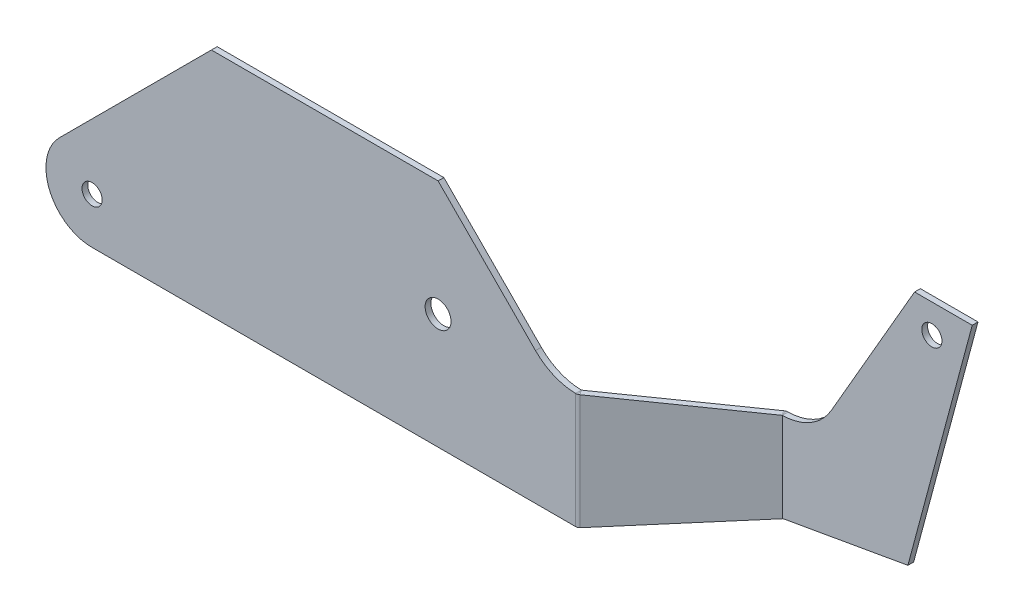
ISO-10303-21;
HEADER;
FILE_DESCRIPTION(('STEP AP214'),'2;1');
FILE_NAME('part.step','',(''),(''),'','','');
FILE_SCHEMA(('AUTOMOTIVE_DESIGN { 1 0 10303 214 1 1 1 1 }'));
ENDSEC;
DATA;
#1=APPLICATION_CONTEXT('core data for automotive mechanical design processes');
#2=APPLICATION_PROTOCOL_DEFINITION('international standard','automotive_design',2000,#1);
#3=PRODUCT_CONTEXT('',#1,'mechanical');
#4=PRODUCT('Part','Part','',(#3));
#5=PRODUCT_RELATED_PRODUCT_CATEGORY('part','',(#4));
#6=PRODUCT_DEFINITION_FORMATION('','',#4);
#7=PRODUCT_DEFINITION_CONTEXT('part definition',#1,'design');
#8=PRODUCT_DEFINITION('design','',#6,#7);
#9=PRODUCT_DEFINITION_SHAPE('','',#8);
#10=(LENGTH_UNIT() NAMED_UNIT(*) SI_UNIT(.MILLI.,.METRE.));
#11=(NAMED_UNIT(*) PLANE_ANGLE_UNIT() SI_UNIT($,.RADIAN.));
#12=(NAMED_UNIT(*) SI_UNIT($,.STERADIAN.) SOLID_ANGLE_UNIT());
#13=UNCERTAINTY_MEASURE_WITH_UNIT(LENGTH_MEASURE(1.E-05),#10,'distance_accuracy_value','');
#14=(GEOMETRIC_REPRESENTATION_CONTEXT(3) GLOBAL_UNCERTAINTY_ASSIGNED_CONTEXT((#13)) GLOBAL_UNIT_ASSIGNED_CONTEXT((#10,
#11,#12)) REPRESENTATION_CONTEXT('',''));
#15=CARTESIAN_POINT('',(0.,0.,0.));
#16=DIRECTION('',(0.,0.,1.));
#17=DIRECTION('',(1.,0.,0.));
#18=AXIS2_PLACEMENT_3D('',#15,#16,#17);
#19=CARTESIAN_POINT('',(24.2959312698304,29.9999896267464,0.90668993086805));
#20=DIRECTION('',(0.573576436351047,0.,0.819152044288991));
#21=DIRECTION('',(0.819152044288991,0.,-0.573576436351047));
#22=AXIS2_PLACEMENT_3D('',#19,#20,#21);
#23=PLANE('',#22);
#24=DIRECTION('',(0.806707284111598,0.173648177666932,-0.564862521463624));
#25=VECTOR('',#24,1.);
#26=CARTESIAN_POINT('',(24.2959312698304,0.,0.90668993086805));
#27=LINE('',#26,#25);
#28=CARTESIAN_POINT('',(24.4235311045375,0.0274665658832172,0.817343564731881));
#29=VERTEX_POINT('',#28);
#30=CARTESIAN_POINT('',(45.0567085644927,4.4688714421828,-13.6301628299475));
#31=VERTEX_POINT('',#30);
#32=EDGE_CURVE('E831',#29,#31,#27,.T.);
#33=ORIENTED_EDGE('',*,*,#32,.T.);
#34=DIRECTION('',(0.,1.,0.));
#35=VECTOR('',#34,1.);
#36=CARTESIAN_POINT('',(45.0567085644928,29.9999896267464,-13.6301628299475));
#37=LINE('',#36,#35);
#38=CARTESIAN_POINT('',(45.0567085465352,19.9999896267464,-13.6301628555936));
#39=VERTEX_POINT('',#38);
#40=EDGE_CURVE('E634',#31,#39,#37,.T.);
#41=ORIENTED_EDGE('',*,*,#40,.T.);
#42=DIRECTION('',(-0.819152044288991,0.,0.573576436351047));
#43=VECTOR('',#42,1.);
#44=CARTESIAN_POINT('',(45.1843083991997,19.9999896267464,-13.7195091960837));
#45=LINE('',#44,#43);
#46=CARTESIAN_POINT('',(24.4235311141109,19.9999896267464,0.817343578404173));
#47=VERTEX_POINT('',#46);
#48=EDGE_CURVE('E828',#39,#47,#45,.T.);
#49=ORIENTED_EDGE('',*,*,#48,.T.);
#50=DIRECTION('',(0.,1.,0.));
#51=VECTOR('',#50,1.);
#52=CARTESIAN_POINT('',(24.4235311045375,29.9999896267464,0.817343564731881));
#53=LINE('',#52,#51);
#54=EDGE_CURVE('E825',#29,#47,#53,.T.);
#55=ORIENTED_EDGE('',*,*,#54,.F.);
#56=EDGE_LOOP('',(#33,#41,#49,#55));
#57=FACE_BOUND('',#56,.T.);
#58=ADVANCED_FACE('F66',(#57),#23,.T.);
#59=CARTESIAN_POINT('',(45.1843083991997,19.9999896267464,-13.7195091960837));
#60=DIRECTION('',(0.,-1.,0.));
#61=DIRECTION('',(0.819152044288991,0.,-0.573576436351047));
#62=AXIS2_PLACEMENT_3D('',#59,#60,#61);
#63=PLANE('',#62);
#64=DIRECTION('',(0.573576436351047,0.,0.819152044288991));
#65=VECTOR('',#64,1.);
#66=CARTESIAN_POINT('',(45.0567085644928,19.9999896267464,-13.6301628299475));
#67=LINE('',#66,#65);
#68=CARTESIAN_POINT('',(44.4831321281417,19.9999896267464,-14.4493148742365));
#69=VERTEX_POINT('',#68);
#70=EDGE_CURVE('E12',#69,#39,#67,.T.);
#71=ORIENTED_EDGE('',*,*,#70,.F.);
#72=DIRECTION('',(-0.819152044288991,0.,0.573576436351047));
#73=VECTOR('',#72,1.);
#74=CARTESIAN_POINT('',(44.6107319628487,19.9999896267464,-14.5386612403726));
#75=LINE('',#74,#73);
#76=CARTESIAN_POINT('',(23.8499546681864,19.9999896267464,-0.00180847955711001));
#77=VERTEX_POINT('',#76);
#78=EDGE_CURVE('E85',#69,#77,#75,.T.);
#79=ORIENTED_EDGE('',*,*,#78,.T.);
#80=DIRECTION('',(0.573576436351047,0.,0.819152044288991));
#81=VECTOR('',#80,1.);
#82=CARTESIAN_POINT('',(24.4235311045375,19.9999896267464,0.817343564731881));
#83=LINE('',#82,#81);
#84=EDGE_CURVE('E822',#77,#47,#83,.T.);
#85=ORIENTED_EDGE('',*,*,#84,.T.);
#86=ORIENTED_EDGE('',*,*,#48,.F.);
#87=EDGE_LOOP('',(#71,#79,#85,#86));
#88=FACE_BOUND('',#87,.T.);
#89=ADVANCED_FACE('F613',(#88),#63,.F.);
#90=CARTESIAN_POINT('',(24.2959312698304,0.,0.90668993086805));
#91=DIRECTION('',(-0.142244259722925,0.984807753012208,0.0996005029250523));
#92=DIRECTION('',(-0.806707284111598,-0.173648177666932,0.564862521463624));
#93=AXIS2_PLACEMENT_3D('',#90,#91,#92);
#94=PLANE('',#93);
#95=CARTESIAN_POINT('',(45.0567085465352,4.46887144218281,-13.6301628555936));
#96=CARTESIAN_POINT('',(44.483132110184,4.46887144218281,-14.4493148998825));
#97=B_SPLINE_CURVE_WITH_KNOTS('',1,(#95,#96),.UNSPECIFIED.,.F.,.F.,(2,2),(0.,1.),.UNSPECIFIED.);
#98=CARTESIAN_POINT('',(44.4831321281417,4.46887144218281,-14.4493148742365));
#99=VERTEX_POINT('',#98);
#100=EDGE_CURVE('E353',#31,#99,#97,.T.);
#101=ORIENTED_EDGE('',*,*,#100,.F.);
#102=ORIENTED_EDGE('',*,*,#32,.F.);
#103=CARTESIAN_POINT('',(23.8499546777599,0.0274665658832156,-0.00180846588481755));
#104=CARTESIAN_POINT('',(24.4235311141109,0.0274665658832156,0.817343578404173));
#105=B_SPLINE_CURVE_WITH_KNOTS('',1,(#103,#104),.UNSPECIFIED.,.F.,.F.,(2,2),(0.,1.),.UNSPECIFIED.);
#106=CARTESIAN_POINT('',(23.8499546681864,0.0274665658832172,-0.00180847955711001));
#107=VERTEX_POINT('',#106);
#108=EDGE_CURVE('E642',#29,#107,#105,.F.);
#109=ORIENTED_EDGE('',*,*,#108,.T.);
#110=DIRECTION('',(0.806707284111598,0.173648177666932,-0.564862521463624));
#111=VECTOR('',#110,1.);
#112=CARTESIAN_POINT('',(23.7223548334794,0.,0.0875378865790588));
#113=LINE('',#112,#111);
#114=EDGE_CURVE('E93',#107,#99,#113,.T.);
#115=ORIENTED_EDGE('',*,*,#114,.T.);
#116=EDGE_LOOP('',(#101,#102,#109,#115));
#117=FACE_BOUND('',#116,.T.);
#118=ADVANCED_FACE('F616',(#117),#94,.F.);
#119=CARTESIAN_POINT('',(23.7223548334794,29.9999896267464,0.0875378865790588));
#120=DIRECTION('',(0.573576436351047,0.,0.819152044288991));
#121=DIRECTION('',(0.819152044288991,0.,-0.573576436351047));
#122=AXIS2_PLACEMENT_3D('',#119,#120,#121);
#123=PLANE('',#122);
#124=DIRECTION('',(0.,1.,0.));
#125=VECTOR('',#124,1.);
#126=CARTESIAN_POINT('',(44.4831321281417,29.9999896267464,-14.4493148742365));
#127=LINE('',#126,#125);
#128=EDGE_CURVE('E77',#99,#69,#127,.T.);
#129=ORIENTED_EDGE('',*,*,#128,.F.);
#130=ORIENTED_EDGE('',*,*,#114,.F.);
#131=DIRECTION('',(0.,1.,0.));
#132=VECTOR('',#131,1.);
#133=CARTESIAN_POINT('',(23.8499546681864,29.9999896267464,-0.00180847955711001));
#134=LINE('',#133,#132);
#135=EDGE_CURVE('E789',#107,#77,#134,.T.);
#136=ORIENTED_EDGE('',*,*,#135,.T.);
#137=ORIENTED_EDGE('',*,*,#78,.F.);
#138=EDGE_LOOP('',(#129,#130,#136,#137));
#139=FACE_BOUND('',#138,.T.);
#140=ADVANCED_FACE('F68',(#139),#123,.F.);
#141=CARTESIAN_POINT('',(-60.0000104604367,8.00000000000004,1.));
#142=DIRECTION('',(0.,0.,-1.));
#143=DIRECTION('',(-1.,0.,0.));
#144=AXIS2_PLACEMENT_3D('',#141,#142,#143);
#145=CYLINDRICAL_SURFACE('',#144,7.99999999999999);
#146=CARTESIAN_POINT('',(-60.0000104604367,8.00000000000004,0.));
#147=DIRECTION('',(0.,0.,1.));
#148=DIRECTION('',(1.,0.,0.));
#149=AXIS2_PLACEMENT_3D('',#146,#147,#148);
#150=CIRCLE('',#149,7.99999999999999);
#151=CARTESIAN_POINT('',(-65.656864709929,13.6568542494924,0.));
#152=VERTEX_POINT('',#151);
#153=CARTESIAN_POINT('',(-60.0000104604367,0.,0.));
#154=VERTEX_POINT('',#153);
#155=EDGE_CURVE('E570',#152,#154,#150,.T.);
#156=ORIENTED_EDGE('',*,*,#155,.T.);
#157=DIRECTION('',(0.,0.,-1.));
#158=VECTOR('',#157,1.);
#159=CARTESIAN_POINT('',(-60.0000104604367,0.,1.));
#160=LINE('',#159,#158);
#161=CARTESIAN_POINT('',(-60.0000104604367,0.,1.));
#162=VERTEX_POINT('',#161);
#163=EDGE_CURVE('E522',#162,#154,#160,.T.);
#164=ORIENTED_EDGE('',*,*,#163,.F.);
#165=CARTESIAN_POINT('',(-60.0000104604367,8.00000000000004,1.));
#166=DIRECTION('',(0.,0.,1.));
#167=DIRECTION('',(1.,0.,0.));
#168=AXIS2_PLACEMENT_3D('',#165,#166,#167);
#169=CIRCLE('',#168,7.99999999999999);
#170=CARTESIAN_POINT('',(-65.656864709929,13.6568542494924,1.));
#171=VERTEX_POINT('',#170);
#172=EDGE_CURVE('E532',#171,#162,#169,.T.);
#173=ORIENTED_EDGE('',*,*,#172,.F.);
#174=DIRECTION('',(0.,0.,-1.));
#175=VECTOR('',#174,1.);
#176=CARTESIAN_POINT('',(-65.656864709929,13.6568542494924,1.));
#177=LINE('',#176,#175);
#178=EDGE_CURVE('E567',#171,#152,#177,.T.);
#179=ORIENTED_EDGE('',*,*,#178,.T.);
#180=EDGE_LOOP('',(#156,#164,#173,#179));
#181=FACE_BOUND('',#180,.T.);
#182=ADVANCED_FACE('F475',(#181),#145,.T.);
#183=CARTESIAN_POINT('',(-65.656864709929,13.6568542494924,1.));
#184=DIRECTION('',(0.707106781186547,-0.707106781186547,0.));
#185=DIRECTION('',(0.707106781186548,0.707106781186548,0.));
#186=AXIS2_PLACEMENT_3D('',#183,#184,#185);
#187=PLANE('',#186);
#188=DIRECTION('',(-0.707106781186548,-0.707106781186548,0.));
#189=VECTOR('',#188,1.);
#190=CARTESIAN_POINT('',(-65.656864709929,13.6568542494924,0.));
#191=LINE('',#190,#189);
#192=CARTESIAN_POINT('',(-39.3137189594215,40.,0.));
#193=VERTEX_POINT('',#192);
#194=EDGE_CURVE('E565',#193,#152,#191,.T.);
#195=ORIENTED_EDGE('',*,*,#194,.T.);
#196=ORIENTED_EDGE('',*,*,#178,.F.);
#197=DIRECTION('',(-0.707106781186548,-0.707106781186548,0.));
#198=VECTOR('',#197,1.);
#199=CARTESIAN_POINT('',(-65.656864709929,13.6568542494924,1.));
#200=LINE('',#199,#198);
#201=CARTESIAN_POINT('',(-39.3137189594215,40.,1.));
#202=VERTEX_POINT('',#201);
#203=EDGE_CURVE('E534',#202,#171,#200,.T.);
#204=ORIENTED_EDGE('',*,*,#203,.F.);
#205=DIRECTION('',(0.,0.,-1.));
#206=VECTOR('',#205,1.);
#207=CARTESIAN_POINT('',(-39.3137189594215,40.,1.));
#208=LINE('',#207,#206);
#209=EDGE_CURVE('E562',#202,#193,#208,.T.);
#210=ORIENTED_EDGE('',*,*,#209,.T.);
#211=EDGE_LOOP('',(#195,#196,#204,#210));
#212=FACE_BOUND('',#211,.T.);
#213=ADVANCED_FACE('F809',(#212),#187,.F.);
#214=CARTESIAN_POINT('',(0.,40.,1.));
#215=DIRECTION('',(0.,-1.,0.));
#216=DIRECTION('',(1.,0.,0.));
#217=AXIS2_PLACEMENT_3D('',#214,#215,#216);
#218=PLANE('',#217);
#219=DIRECTION('',(-1.,0.,0.));
#220=VECTOR('',#219,1.);
#221=CARTESIAN_POINT('',(0.,40.,0.));
#222=LINE('',#221,#220);
#223=CARTESIAN_POINT('',(0.,40.,0.));
#224=VERTEX_POINT('',#223);
#225=EDGE_CURVE('E560',#224,#193,#222,.T.);
#226=ORIENTED_EDGE('',*,*,#225,.T.);
#227=ORIENTED_EDGE('',*,*,#209,.F.);
#228=DIRECTION('',(-1.,0.,0.));
#229=VECTOR('',#228,1.);
#230=CARTESIAN_POINT('',(0.,40.,1.));
#231=LINE('',#230,#229);
#232=CARTESIAN_POINT('',(0.,40.,1.));
#233=VERTEX_POINT('',#232);
#234=EDGE_CURVE('E536',#233,#202,#231,.T.);
#235=ORIENTED_EDGE('',*,*,#234,.F.);
#236=DIRECTION('',(0.,0.,-1.));
#237=VECTOR('',#236,1.);
#238=CARTESIAN_POINT('',(0.,40.,1.));
#239=LINE('',#238,#237);
#240=EDGE_CURVE('E557',#233,#224,#239,.T.);
#241=ORIENTED_EDGE('',*,*,#240,.T.);
#242=EDGE_LOOP('',(#226,#227,#235,#241));
#243=FACE_BOUND('',#242,.T.);
#244=ADVANCED_FACE('F812',(#243),#218,.F.);
#245=CARTESIAN_POINT('',(0.,40.,1.));
#246=DIRECTION('',(-0.710059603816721,-0.704141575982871,0.));
#247=DIRECTION('',(0.704141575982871,-0.710059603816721,0.));
#248=AXIS2_PLACEMENT_3D('',#245,#246,#247);
#249=PLANE('',#248);
#250=DIRECTION('',(-0.704141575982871,0.710059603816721,0.));
#251=VECTOR('',#250,1.);
#252=CARTESIAN_POINT('',(0.,40.,0.));
#253=LINE('',#252,#251);
#254=CARTESIAN_POINT('',(16.8993935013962,22.9585738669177,0.));
#255=VERTEX_POINT('',#254);
#256=EDGE_CURVE('E554',#255,#224,#253,.T.);
#257=ORIENTED_EDGE('',*,*,#256,.T.);
#258=ORIENTED_EDGE('',*,*,#240,.F.);
#259=DIRECTION('',(-0.704141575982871,0.710059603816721,0.));
#260=VECTOR('',#259,1.);
#261=CARTESIAN_POINT('',(0.,40.,1.));
#262=LINE('',#261,#260);
#263=CARTESIAN_POINT('',(16.8993935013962,22.9585738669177,1.));
#264=VERTEX_POINT('',#263);
#265=EDGE_CURVE('E538',#264,#233,#262,.T.);
#266=ORIENTED_EDGE('',*,*,#265,.F.);
#267=DIRECTION('',(0.,0.,-1.));
#268=VECTOR('',#267,1.);
#269=CARTESIAN_POINT('',(16.8993935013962,22.9585738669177,1.));
#270=LINE('',#269,#268);
#271=EDGE_CURVE('E551',#264,#255,#270,.T.);
#272=ORIENTED_EDGE('',*,*,#271,.T.);
#273=EDGE_LOOP('',(#257,#258,#266,#272));
#274=FACE_BOUND('',#273,.T.);
#275=ADVANCED_FACE('F816',(#274),#249,.F.);
#276=CARTESIAN_POINT('',(-60.0000104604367,8.00000000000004,1.));
#277=DIRECTION('',(0.,0.,-1.));
#278=DIRECTION('',(-1.,0.,0.));
#279=AXIS2_PLACEMENT_3D('',#276,#277,#278);
#280=CYLINDRICAL_SURFACE('',#279,1.75);
#281=CARTESIAN_POINT('',(-60.0000104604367,8.00000000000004,1.));
#282=DIRECTION('',(0.,0.,1.));
#283=DIRECTION('',(1.,0.,0.));
#284=AXIS2_PLACEMENT_3D('',#281,#282,#283);
#285=CIRCLE('',#284,1.75);
#286=CARTESIAN_POINT('',(-58.2500104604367,8.00000000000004,1.));
#287=VERTEX_POINT('',#286);
#288=EDGE_CURVE('E548',#287,#287,#285,.T.);
#289=ORIENTED_EDGE('',*,*,#288,.T.);
#290=EDGE_LOOP('',(#289));
#291=FACE_BOUND('',#290,.T.);
#292=CARTESIAN_POINT('',(-60.0000104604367,8.00000000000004,0.));
#293=DIRECTION('',(0.,0.,1.));
#294=DIRECTION('',(1.,0.,0.));
#295=AXIS2_PLACEMENT_3D('',#292,#293,#294);
#296=CIRCLE('',#295,1.75);
#297=CARTESIAN_POINT('',(-58.2500104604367,8.00000000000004,0.));
#298=VERTEX_POINT('',#297);
#299=EDGE_CURVE('E525',#298,#298,#296,.T.);
#300=ORIENTED_EDGE('',*,*,#299,.F.);
#301=EDGE_LOOP('',(#300));
#302=FACE_BOUND('',#301,.T.);
#303=ADVANCED_FACE('F1053',(#291,#302),#280,.F.);
#304=CARTESIAN_POINT('',(0.,19.9999896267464,1.));
#305=DIRECTION('',(0.,0.,-1.));
#306=DIRECTION('',(-1.,0.,0.));
#307=AXIS2_PLACEMENT_3D('',#304,#305,#306);
#308=CYLINDRICAL_SURFACE('',#307,2.25);
#309=CARTESIAN_POINT('',(0.,19.9999896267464,1.));
#310=DIRECTION('',(0.,0.,1.));
#311=DIRECTION('',(1.,0.,0.));
#312=AXIS2_PLACEMENT_3D('',#309,#310,#311);
#313=CIRCLE('',#312,2.25);
#314=CARTESIAN_POINT('',(2.25,19.9999896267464,1.));
#315=VERTEX_POINT('',#314);
#316=EDGE_CURVE('E545',#315,#315,#313,.T.);
#317=ORIENTED_EDGE('',*,*,#316,.T.);
#318=EDGE_LOOP('',(#317));
#319=FACE_BOUND('',#318,.T.);
#320=CARTESIAN_POINT('',(0.,19.9999896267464,0.));
#321=DIRECTION('',(0.,0.,1.));
#322=DIRECTION('',(1.,0.,0.));
#323=AXIS2_PLACEMENT_3D('',#320,#321,#322);
#324=CIRCLE('',#323,2.25);
#325=CARTESIAN_POINT('',(2.25,19.9999896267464,0.));
#326=VERTEX_POINT('',#325);
#327=EDGE_CURVE('E528',#326,#326,#324,.T.);
#328=ORIENTED_EDGE('',*,*,#327,.F.);
#329=EDGE_LOOP('',(#328));
#330=FACE_BOUND('',#329,.T.);
#331=ADVANCED_FACE('F1044',(#319,#330),#308,.F.);
#332=CARTESIAN_POINT('',(23.9999895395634,29.9999896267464,1.));
#333=DIRECTION('',(0.,0.,1.));
#334=DIRECTION('',(1.,0.,0.));
#335=AXIS2_PLACEMENT_3D('',#332,#333,#334);
#336=PLANE('',#335);
#337=ORIENTED_EDGE('',*,*,#316,.F.);
#338=EDGE_LOOP('',(#337));
#339=FACE_BOUND('',#338,.T.);
#340=ORIENTED_EDGE('',*,*,#288,.F.);
#341=EDGE_LOOP('',(#340));
#342=FACE_BOUND('',#341,.T.);
#343=DIRECTION('',(1.,0.,0.));
#344=VECTOR('',#343,1.);
#345=CARTESIAN_POINT('',(23.9999895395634,0.,1.));
#346=LINE('',#345,#344);
#347=CARTESIAN_POINT('',(23.8442189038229,0.,1.));
#348=VERTEX_POINT('',#347);
#349=EDGE_CURVE('E542',#162,#348,#346,.T.);
#350=ORIENTED_EDGE('',*,*,#349,.T.);
#351=DIRECTION('',(0.,1.,0.));
#352=VECTOR('',#351,1.);
#353=CARTESIAN_POINT('',(23.8442189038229,29.9999896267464,1.));
#354=LINE('',#353,#352);
#355=CARTESIAN_POINT('',(23.8442189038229,20.001202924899,1.00000001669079));
#356=VERTEX_POINT('',#355);
#357=EDGE_CURVE('E544',#348,#356,#354,.T.);
#358=ORIENTED_EDGE('',*,*,#357,.T.);
#359=CARTESIAN_POINT('',(23.9999895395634,29.9999896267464,1.));
#360=DIRECTION('',(0.,0.,-1.));
#361=DIRECTION('',(1.,0.,0.));
#362=AXIS2_PLACEMENT_3D('',#359,#360,#361);
#363=CIRCLE('',#362,10.);
#364=EDGE_CURVE('E541',#356,#264,#363,.T.);
#365=ORIENTED_EDGE('',*,*,#364,.T.);
#366=ORIENTED_EDGE('',*,*,#265,.T.);
#367=ORIENTED_EDGE('',*,*,#234,.T.);
#368=ORIENTED_EDGE('',*,*,#203,.T.);
#369=ORIENTED_EDGE('',*,*,#172,.T.);
#370=EDGE_LOOP('',(#350,#358,#365,#366,#367,#368,#369));
#371=FACE_BOUND('',#370,.T.);
#372=ADVANCED_FACE('F604',(#339,#342,#371),#336,.T.);
#373=CARTESIAN_POINT('',(23.9999895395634,29.9999896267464,1.));
#374=DIRECTION('',(0.,0.,-1.));
#375=DIRECTION('',(-1.,0.,0.));
#376=AXIS2_PLACEMENT_3D('',#373,#374,#375);
#377=CYLINDRICAL_SURFACE('',#376,10.);
#378=CARTESIAN_POINT('',(23.8442189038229,20.001202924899,1.66907874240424E-08));
#379=CARTESIAN_POINT('',(23.8442189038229,20.001202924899,1.00000001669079));
#380=B_SPLINE_CURVE_WITH_KNOTS('',1,(#378,#379),.UNSPECIFIED.,.F.,.F.,(2,2),(0.,1.),.UNSPECIFIED.);
#381=CARTESIAN_POINT('',(23.8442189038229,20.001202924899,0.));
#382=VERTEX_POINT('',#381);
#383=EDGE_CURVE('E572',#382,#356,#380,.T.);
#384=ORIENTED_EDGE('',*,*,#383,.F.);
#385=CARTESIAN_POINT('',(23.9999895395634,29.9999896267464,0.));
#386=DIRECTION('',(0.,0.,-1.));
#387=DIRECTION('',(1.,0.,0.));
#388=AXIS2_PLACEMENT_3D('',#385,#386,#387);
#389=CIRCLE('',#388,10.);
#390=EDGE_CURVE('E531',#382,#255,#389,.T.);
#391=ORIENTED_EDGE('',*,*,#390,.T.);
#392=ORIENTED_EDGE('',*,*,#271,.F.);
#393=ORIENTED_EDGE('',*,*,#364,.F.);
#394=EDGE_LOOP('',(#384,#391,#392,#393));
#395=FACE_BOUND('',#394,.T.);
#396=ADVANCED_FACE('F593',(#395),#377,.F.);
#397=CARTESIAN_POINT('',(23.9999895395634,29.9999896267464,0.));
#398=DIRECTION('',(0.,0.,1.));
#399=DIRECTION('',(1.,0.,0.));
#400=AXIS2_PLACEMENT_3D('',#397,#398,#399);
#401=PLANE('',#400);
#402=DIRECTION('',(0.,1.,0.));
#403=VECTOR('',#402,1.);
#404=CARTESIAN_POINT('',(23.8442189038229,29.9999896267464,0.));
#405=LINE('',#404,#403);
#406=CARTESIAN_POINT('',(23.8442189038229,0.,0.));
#407=VERTEX_POINT('',#406);
#408=EDGE_CURVE('E576',#407,#382,#405,.T.);
#409=ORIENTED_EDGE('',*,*,#408,.F.);
#410=DIRECTION('',(1.,0.,0.));
#411=VECTOR('',#410,1.);
#412=CARTESIAN_POINT('',(23.9999895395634,0.,0.));
#413=LINE('',#412,#411);
#414=EDGE_CURVE('E515',#154,#407,#413,.T.);
#415=ORIENTED_EDGE('',*,*,#414,.F.);
#416=ORIENTED_EDGE('',*,*,#155,.F.);
#417=ORIENTED_EDGE('',*,*,#194,.F.);
#418=ORIENTED_EDGE('',*,*,#225,.F.);
#419=ORIENTED_EDGE('',*,*,#256,.F.);
#420=ORIENTED_EDGE('',*,*,#390,.F.);
#421=EDGE_LOOP('',(#409,#415,#416,#417,#418,#419,#420));
#422=FACE_BOUND('',#421,.T.);
#423=ORIENTED_EDGE('',*,*,#327,.T.);
#424=EDGE_LOOP('',(#423));
#425=FACE_BOUND('',#424,.T.);
#426=ORIENTED_EDGE('',*,*,#299,.T.);
#427=EDGE_LOOP('',(#426));
#428=FACE_BOUND('',#427,.T.);
#429=ADVANCED_FACE('F603',(#422,#425,#428),#401,.F.);
#430=CARTESIAN_POINT('',(23.9999895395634,0.,1.));
#431=DIRECTION('',(0.,1.,0.));
#432=DIRECTION('',(-1.,0.,0.));
#433=AXIS2_PLACEMENT_3D('',#430,#431,#432);
#434=PLANE('',#433);
#435=DIRECTION('',(0.,0.,-1.));
#436=VECTOR('',#435,1.);
#437=CARTESIAN_POINT('',(23.8442189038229,0.,1.));
#438=LINE('',#437,#436);
#439=EDGE_CURVE('E573',#348,#407,#438,.T.);
#440=ORIENTED_EDGE('',*,*,#439,.F.);
#441=ORIENTED_EDGE('',*,*,#349,.F.);
#442=ORIENTED_EDGE('',*,*,#163,.T.);
#443=ORIENTED_EDGE('',*,*,#414,.T.);
#444=EDGE_LOOP('',(#440,#441,#442,#443));
#445=FACE_BOUND('',#444,.T.);
#446=ADVANCED_FACE('F608',(#445),#434,.F.);
#447=CARTESIAN_POINT('',(23.8442189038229,0.,-0.0100000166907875));
#448=DIRECTION('',(0.,-1.,0.));
#449=DIRECTION('',(0.,0.,-1.));
#450=AXIS2_PLACEMENT_3D('',#447,#448,#449);
#451=PLANE('',#450);
#452=ORIENTED_EDGE('',*,*,#439,.T.);
#453=CARTESIAN_POINT('',(23.8442189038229,0.,-0.01));
#454=DIRECTION('',(0.,1.,0.));
#455=DIRECTION('',(0.,0.,1.));
#456=AXIS2_PLACEMENT_3D('',#453,#454,#455);
#457=CIRCLE('',#456,0.0100000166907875);
#458=CARTESIAN_POINT('',(23.847225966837,0.,-0.000462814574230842));
#459=VERTEX_POINT('',#458);
#460=EDGE_CURVE('E723',#407,#459,#457,.T.);
#461=ORIENTED_EDGE('',*,*,#460,.T.);
#462=CARTESIAN_POINT('',(24.1479317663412,0.,0.953254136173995));
#463=CARTESIAN_POINT('',(23.847225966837,0.,-0.000462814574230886));
#464=B_SPLINE_CURVE_WITH_KNOTS('',1,(#462,#463),.UNSPECIFIED.,.F.,.F.,(2,2),(0.,1.),.UNSPECIFIED.);
#465=CARTESIAN_POINT('',(24.1479317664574,0.,0.95325413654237));
#466=VERTEX_POINT('',#465);
#467=EDGE_CURVE('E577',#459,#466,#464,.F.);
#468=ORIENTED_EDGE('',*,*,#467,.T.);
#469=CARTESIAN_POINT('',(23.8442189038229,0.,-0.0100000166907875));
#470=DIRECTION('',(0.,1.,0.));
#471=DIRECTION('',(0.,0.,1.));
#472=AXIS2_PLACEMENT_3D('',#469,#470,#471);
#473=CIRCLE('',#472,1.01000003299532);
#474=EDGE_CURVE('E792',#348,#466,#473,.T.);
#475=ORIENTED_EDGE('',*,*,#474,.F.);
#476=EDGE_LOOP('',(#452,#461,#468,#475));
#477=FACE_BOUND('',#476,.T.);
#478=ADVANCED_FACE('F473',(#477),#451,.T.);
#479=CARTESIAN_POINT('',(24.1479317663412,0.,0.953254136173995));
#480=CARTESIAN_POINT('',(24.2460242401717,0.00915764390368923,0.92232569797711));
#481=CARTESIAN_POINT('',(24.3392790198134,0.0183089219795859,0.876337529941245));
#482=CARTESIAN_POINT('',(24.4235311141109,0.0274665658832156,0.817343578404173));
#483=CARTESIAN_POINT('',(23.847225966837,0.,-0.000462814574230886));
#484=CARTESIAN_POINT('',(23.8481969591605,0.00915555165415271,-0.000768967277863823));
#485=CARTESIAN_POINT('',(23.8491206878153,0.0183110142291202,-0.00122449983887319));
#486=CARTESIAN_POINT('',(23.8499546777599,0.0274665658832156,-0.00180846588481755));
#487=B_SPLINE_SURFACE_WITH_KNOTS('',1,3,((#479,#480,#481,#482),(#483,#484,#485,#486)),
.UNSPECIFIED.,.F.,.F.,.F.,(2,2),(4,4),(0.,1.),(0.,1.),.UNSPECIFIED.);
#488=CARTESIAN_POINT('',(23.847225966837,0.,-0.000462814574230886));
#489=CARTESIAN_POINT('',(23.8481969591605,0.00915555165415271,-0.000768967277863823));
#490=CARTESIAN_POINT('',(23.8491206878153,0.0183110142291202,-0.00122449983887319));
#491=CARTESIAN_POINT('',(23.8499546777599,0.0274665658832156,-0.00180846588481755));
#492=B_SPLINE_CURVE_WITH_KNOTS('',3,(#488,#489,#490,#491),.UNSPECIFIED.,.F.,.F.,(4,4),(0.,1.),.UNSPECIFIED.);
#493=EDGE_CURVE('E451',#459,#107,#492,.T.);
#494=CARTESIAN_POINT('',(24.4235311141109,0.0274665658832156,0.817343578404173));
#495=CARTESIAN_POINT('',(24.3392790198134,0.0183089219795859,0.876337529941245));
#496=CARTESIAN_POINT('',(24.2460242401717,0.00915764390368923,0.92232569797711));
#497=CARTESIAN_POINT('',(24.1479317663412,0.,0.953254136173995));
#498=B_SPLINE_CURVE_WITH_KNOTS('',3,(#494,#495,#496,#497),.UNSPECIFIED.,.F.,.F.,(4,4),(0.,1.),.UNSPECIFIED.);
#499=EDGE_CURVE('E430',#466,#29,#498,.F.);
#500=ORIENTED_EDGE('',*,*,#467,.F.);
#501=ORIENTED_EDGE('',*,*,#493,.T.);
#502=ORIENTED_EDGE('',*,*,#108,.F.);
#503=ORIENTED_EDGE('',*,*,#499,.F.);
#504=EDGE_LOOP('',(#500,#501,#502,#503));
#505=FACE_BOUND('',#504,.T.);
#506=ADVANCED_FACE('F742',(#505),#487,.T.);
#507=CARTESIAN_POINT('',(23.8442189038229,19.9999896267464,-0.0100000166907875));
#508=DIRECTION('',(0.,1.,0.));
#509=DIRECTION('',(0.,0.,1.));
#510=AXIS2_PLACEMENT_3D('',#507,#508,#509);
#511=PLANE('',#510);
#512=ORIENTED_EDGE('',*,*,#84,.F.);
#513=CARTESIAN_POINT('',(23.8442189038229,19.9999896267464,-0.01));
#514=DIRECTION('',(0.,1.,0.));
#515=DIRECTION('',(0.,0.,1.));
#516=AXIS2_PLACEMENT_3D('',#513,#514,#515);
#517=CIRCLE('',#516,0.0100000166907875);
#518=CARTESIAN_POINT('',(23.847225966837,19.9999896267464,-0.000462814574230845));
#519=VERTEX_POINT('',#518);
#520=EDGE_CURVE('E443',#77,#519,#517,.F.);
#521=ORIENTED_EDGE('',*,*,#520,.T.);
#522=CARTESIAN_POINT('',(24.1479317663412,19.9999896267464,0.953254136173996));
#523=CARTESIAN_POINT('',(23.847225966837,19.9999896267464,-0.000462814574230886));
#524=B_SPLINE_CURVE_WITH_KNOTS('',1,(#522,#523),.UNSPECIFIED.,.F.,.F.,(2,2),(0.,1.),.UNSPECIFIED.);
#525=CARTESIAN_POINT('',(24.1479317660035,19.9999896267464,0.953254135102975));
#526=VERTEX_POINT('',#525);
#527=EDGE_CURVE('E503',#519,#526,#524,.F.);
#528=ORIENTED_EDGE('',*,*,#527,.T.);
#529=CARTESIAN_POINT('',(23.8442189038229,19.9999896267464,-0.0100000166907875));
#530=DIRECTION('',(0.,-1.,0.));
#531=DIRECTION('',(0.,0.,-1.));
#532=AXIS2_PLACEMENT_3D('',#529,#530,#531);
#533=CIRCLE('',#532,1.01000003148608);
#534=EDGE_CURVE('E428',#47,#526,#533,.T.);
#535=ORIENTED_EDGE('',*,*,#534,.F.);
#536=EDGE_LOOP('',(#512,#521,#528,#535));
#537=FACE_BOUND('',#536,.T.);
#538=ADVANCED_FACE('F404',(#537),#511,.T.);
#539=CARTESIAN_POINT('',(24.1479317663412,19.9999896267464,0.953254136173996));
#540=CARTESIAN_POINT('',(24.0498391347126,20.0003941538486,0.984182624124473));
#541=CARTESIAN_POINT('',(23.9470718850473,20.0007983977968,1.00000001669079));
#542=CARTESIAN_POINT('',(23.8442189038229,20.001202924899,1.00000001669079));
#543=CARTESIAN_POINT('',(23.847225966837,19.9999896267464,-0.000462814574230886));
#544=CARTESIAN_POINT('',(23.8462547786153,20.0003941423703,-0.000156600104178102));
#545=CARTESIAN_POINT('',(23.8452372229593,20.0007984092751,1.66907874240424E-08));
#546=CARTESIAN_POINT('',(23.8442189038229,20.001202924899,1.66907874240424E-08));
#547=B_SPLINE_SURFACE_WITH_KNOTS('',1,3,((#539,#540,#541,#542),(#543,#544,#545,#546)),
.UNSPECIFIED.,.F.,.F.,.F.,(2,2),(4,4),(0.,1.),(0.,1.),.UNSPECIFIED.);
#548=CARTESIAN_POINT('',(23.847225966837,19.9999896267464,-0.000462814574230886));
#549=CARTESIAN_POINT('',(23.8462547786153,20.0003941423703,-0.000156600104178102));
#550=CARTESIAN_POINT('',(23.8452372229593,20.0007984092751,1.66907874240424E-08));
#551=CARTESIAN_POINT('',(23.8442189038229,20.001202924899,1.66907874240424E-08));
#552=B_SPLINE_CURVE_WITH_KNOTS('',3,(#548,#549,#550,#551),.UNSPECIFIED.,.F.,.F.,(4,4),(0.,1.),.UNSPECIFIED.);
#553=EDGE_CURVE('E439',#519,#382,#552,.T.);
#554=CARTESIAN_POINT('',(23.8442189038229,20.001202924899,1.00000001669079));
#555=CARTESIAN_POINT('',(23.9470718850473,20.0007983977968,1.00000001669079));
#556=CARTESIAN_POINT('',(24.0498391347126,20.0003941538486,0.984182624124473));
#557=CARTESIAN_POINT('',(24.1479317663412,19.9999896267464,0.953254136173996));
#558=B_SPLINE_CURVE_WITH_KNOTS('',3,(#554,#555,#556,#557),.UNSPECIFIED.,.F.,.F.,(4,4),(0.,1.),.UNSPECIFIED.);
#559=EDGE_CURVE('E427',#526,#356,#558,.F.);
#560=ORIENTED_EDGE('',*,*,#553,.T.);
#561=ORIENTED_EDGE('',*,*,#383,.T.);
#562=ORIENTED_EDGE('',*,*,#559,.F.);
#563=ORIENTED_EDGE('',*,*,#527,.F.);
#564=EDGE_LOOP('',(#560,#561,#562,#563));
#565=FACE_BOUND('',#564,.T.);
#566=ADVANCED_FACE('F402',(#565),#547,.T.);
#567=CARTESIAN_POINT('',(23.8442189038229,-10.0280074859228,-0.01));
#568=DIRECTION('',(0.,1.,0.));
#569=DIRECTION('',(0.,0.,1.));
#570=AXIS2_PLACEMENT_3D('',#567,#568,#569);
#571=CYLINDRICAL_SURFACE('',#570,1.01000001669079);
#572=ORIENTED_EDGE('',*,*,#534,.T.);
#573=ORIENTED_EDGE('',*,*,#559,.T.);
#574=ORIENTED_EDGE('',*,*,#357,.F.);
#575=ORIENTED_EDGE('',*,*,#474,.T.);
#576=ORIENTED_EDGE('',*,*,#499,.T.);
#577=ORIENTED_EDGE('',*,*,#54,.T.);
#578=EDGE_LOOP('',(#572,#573,#574,#575,#576,#577));
#579=FACE_BOUND('',#578,.T.);
#580=ADVANCED_FACE('F393',(#579),#571,.T.);
#581=CARTESIAN_POINT('',(23.8442189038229,-10.0280074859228,-0.01));
#582=DIRECTION('',(0.,1.,0.));
#583=DIRECTION('',(0.,0.,1.));
#584=AXIS2_PLACEMENT_3D('',#581,#582,#583);
#585=CYLINDRICAL_SURFACE('',#584,0.0100000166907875);
#586=ORIENTED_EDGE('',*,*,#520,.F.);
#587=ORIENTED_EDGE('',*,*,#135,.F.);
#588=ORIENTED_EDGE('',*,*,#493,.F.);
#589=ORIENTED_EDGE('',*,*,#460,.F.);
#590=ORIENTED_EDGE('',*,*,#408,.T.);
#591=ORIENTED_EDGE('',*,*,#553,.F.);
#592=EDGE_LOOP('',(#586,#587,#588,#589,#590,#591));
#593=FACE_BOUND('',#592,.T.);
#594=ADVANCED_FACE('F327',(#593),#585,.F.);
#595=CARTESIAN_POINT('',(44.483132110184,4.46887144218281,-14.4493148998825));
#596=CARTESIAN_POINT('',(44.65205136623,4.48711063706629,-14.5675934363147));
#597=CARTESIAN_POINT('',(44.856232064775,4.50532296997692,-14.6319713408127));
#598=CARTESIAN_POINT('',(45.0624443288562,4.52380457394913,-14.6319713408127));
#599=CARTESIAN_POINT('',(45.0567085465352,4.46887144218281,-13.6301628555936));
#600=CARTESIAN_POINT('',(45.0583766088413,4.48706253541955,-13.6313308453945));
#601=CARTESIAN_POINT('',(45.0604080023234,4.50537171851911,-13.6319713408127));
#602=CARTESIAN_POINT('',(45.0624443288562,4.52380457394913,-13.6319713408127));
#603=B_SPLINE_SURFACE_WITH_KNOTS('',1,3,((#595,#596,#597,#598),(#599,#600,#601,#602)),
.UNSPECIFIED.,.F.,.F.,.F.,(2,2),(4,4),(0.,1.),(0.,1.),.UNSPECIFIED.);
#604=CARTESIAN_POINT('',(44.483132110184,4.46887144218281,-14.4493148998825));
#605=CARTESIAN_POINT('',(44.65205136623,4.48711063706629,-14.5675934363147));
#606=CARTESIAN_POINT('',(44.856232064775,4.50532296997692,-14.6319713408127));
#607=CARTESIAN_POINT('',(45.0624443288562,4.52380457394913,-14.6319713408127));
#608=B_SPLINE_CURVE_WITH_KNOTS('',3,(#604,#605,#606,#607),.UNSPECIFIED.,.F.,.F.,(4,4),(0.,1.),.UNSPECIFIED.);
#609=CARTESIAN_POINT('',(45.0624443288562,4.52380457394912,-14.6319713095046));
#610=VERTEX_POINT('',#609);
#611=EDGE_CURVE('E300',#99,#610,#608,.T.);
#612=CARTESIAN_POINT('',(45.0624443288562,4.52380457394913,-14.6319713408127));
#613=CARTESIAN_POINT('',(45.0624443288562,4.52380457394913,-13.6319713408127));
#614=B_SPLINE_CURVE_WITH_KNOTS('',1,(#612,#613),.UNSPECIFIED.,.F.,.F.,(2,2),(0.,1.),.UNSPECIFIED.);
#615=CARTESIAN_POINT('',(45.0624443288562,4.52380457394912,-13.6319713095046));
#616=VERTEX_POINT('',#615);
#617=EDGE_CURVE('E215',#616,#610,#614,.F.);
#618=CARTESIAN_POINT('',(45.0624443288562,4.52380457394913,-13.6319713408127));
#619=CARTESIAN_POINT('',(45.0604080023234,4.50537171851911,-13.6319713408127));
#620=CARTESIAN_POINT('',(45.0583766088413,4.48706253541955,-13.6313308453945));
#621=CARTESIAN_POINT('',(45.0567085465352,4.46887144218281,-13.6301628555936));
#622=B_SPLINE_CURVE_WITH_KNOTS('',3,(#618,#619,#620,#621),.UNSPECIFIED.,.F.,.F.,(4,4),(0.,1.),.UNSPECIFIED.);
#623=EDGE_CURVE('E294',#31,#616,#622,.F.);
#624=ORIENTED_EDGE('',*,*,#100,.T.);
#625=ORIENTED_EDGE('',*,*,#611,.T.);
#626=ORIENTED_EDGE('',*,*,#617,.F.);
#627=ORIENTED_EDGE('',*,*,#623,.F.);
#628=EDGE_LOOP('',(#624,#625,#626,#627));
#629=FACE_BOUND('',#628,.T.);
#630=ADVANCED_FACE('F316',(#629),#603,.F.);
#631=CARTESIAN_POINT('',(45.0624443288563,20.001202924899,-14.6319713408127));
#632=CARTESIAN_POINT('',(44.9672691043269,20.0005253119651,-14.6319713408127));
#633=CARTESIAN_POINT('',(44.864117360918,20.0001204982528,-14.6184535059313));
#634=CARTESIAN_POINT('',(44.7587314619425,19.9999896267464,-14.5852254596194));
#635=CARTESIAN_POINT('',(45.0624443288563,20.001202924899,-13.6319713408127));
#636=CARTESIAN_POINT('',(45.0615016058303,20.0005250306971,-13.6319713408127));
#637=CARTESIAN_POINT('',(45.0604809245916,20.0001205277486,-13.6318375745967));
#638=CARTESIAN_POINT('',(45.0594372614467,19.9999896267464,-13.6315085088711));
#639=B_SPLINE_SURFACE_WITH_KNOTS('',1,3,((#631,#632,#633,#634),(#635,#636,#637,#638)),
.UNSPECIFIED.,.F.,.F.,.F.,(2,2),(4,4),(0.,1.),(0.,1.),.UNSPECIFIED.);
#640=CARTESIAN_POINT('',(45.0624443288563,20.001202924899,-13.6319713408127));
#641=CARTESIAN_POINT('',(45.0624443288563,20.001202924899,-14.6319713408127));
#642=B_SPLINE_CURVE_WITH_KNOTS('',1,(#640,#641),.UNSPECIFIED.,.F.,.F.,(2,2),(0.,1.),.UNSPECIFIED.);
#643=CARTESIAN_POINT('',(45.0624443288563,20.001202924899,-14.6319713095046));
#644=VERTEX_POINT('',#643);
#645=CARTESIAN_POINT('',(45.0624443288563,20.001202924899,-13.6319713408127));
#646=VERTEX_POINT('',#645);
#647=EDGE_CURVE('E684',#644,#646,#642,.F.);
#648=CARTESIAN_POINT('',(45.0624443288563,20.001202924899,-14.6319713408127));
#649=CARTESIAN_POINT('',(44.9672691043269,20.0005253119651,-14.6319713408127));
#650=CARTESIAN_POINT('',(44.864117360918,20.0001204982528,-14.6184535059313));
#651=CARTESIAN_POINT('',(44.7587314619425,19.9999896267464,-14.5852254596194));
#652=B_SPLINE_CURVE_WITH_KNOTS('',3,(#648,#649,#650,#651),.UNSPECIFIED.,.F.,.F.,(4,4),(0.,1.),.UNSPECIFIED.);
#653=CARTESIAN_POINT('',(44.7587314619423,19.9999896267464,-14.5852254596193));
#654=VERTEX_POINT('',#653);
#655=EDGE_CURVE('E689',#644,#654,#652,.T.);
#656=CARTESIAN_POINT('',(44.7587314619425,19.9999896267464,-14.5852254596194));
#657=CARTESIAN_POINT('',(45.0594372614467,19.9999896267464,-13.6315085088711));
#658=B_SPLINE_CURVE_WITH_KNOTS('',1,(#656,#657),.UNSPECIFIED.,.F.,.F.,(2,2),(0.,1.),.UNSPECIFIED.);
#659=CARTESIAN_POINT('',(45.0594372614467,19.9999896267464,-13.6315085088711));
#660=VERTEX_POINT('',#659);
#661=EDGE_CURVE('E366',#654,#660,#658,.T.);
#662=CARTESIAN_POINT('',(45.0594372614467,19.9999896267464,-13.6315085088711));
#663=CARTESIAN_POINT('',(45.0604809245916,20.0001205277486,-13.6318375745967));
#664=CARTESIAN_POINT('',(45.0615016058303,20.0005250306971,-13.6319713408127));
#665=CARTESIAN_POINT('',(45.0624443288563,20.001202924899,-13.6319713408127));
#666=B_SPLINE_CURVE_WITH_KNOTS('',3,(#662,#663,#664,#665),.UNSPECIFIED.,.F.,.F.,(4,4),(0.,1.),.UNSPECIFIED.);
#667=EDGE_CURVE('E691',#646,#660,#666,.F.);
#668=ORIENTED_EDGE('',*,*,#647,.F.);
#669=ORIENTED_EDGE('',*,*,#655,.T.);
#670=ORIENTED_EDGE('',*,*,#661,.T.);
#671=ORIENTED_EDGE('',*,*,#667,.F.);
#672=EDGE_LOOP('',(#668,#669,#670,#671));
#673=FACE_BOUND('',#672,.T.);
#674=ADVANCED_FACE('F269',(#673),#639,.F.);
#675=CARTESIAN_POINT('',(45.0624443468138,19.9999896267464,-13.6219712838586));
#676=DIRECTION('',(2.1667545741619E-11,-1.,-6.83177335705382E-12));
#677=DIRECTION('',(1.,2.1667545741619E-11,0.));
#678=AXIS2_PLACEMENT_3D('',#675,#676,#677);
#679=PLANE('',#678);
#680=CARTESIAN_POINT('',(45.0624443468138,19.9999896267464,-13.6219712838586));
#681=DIRECTION('',(-2.1667545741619E-11,1.,6.83177335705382E-12));
#682=DIRECTION('',(-1.,-2.1667545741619E-11,0.));
#683=AXIS2_PLACEMENT_3D('',#680,#681,#682);
#684=CIRCLE('',#683,1.01000003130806);
#685=EDGE_CURVE('E694',#654,#69,#684,.T.);
#686=ORIENTED_EDGE('',*,*,#685,.T.);
#687=ORIENTED_EDGE('',*,*,#70,.T.);
#688=CARTESIAN_POINT('',(45.0624443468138,19.9999896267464,-13.6219712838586));
#689=DIRECTION('',(-2.1667545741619E-11,1.,6.83177335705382E-12));
#690=DIRECTION('',(-1.,-2.1667545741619E-11,0.));
#691=AXIS2_PLACEMENT_3D('',#688,#689,#690);
#692=CIRCLE('',#691,0.0100000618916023);
#693=EDGE_CURVE('E719',#660,#39,#692,.T.);
#694=ORIENTED_EDGE('',*,*,#693,.F.);
#695=ORIENTED_EDGE('',*,*,#661,.F.);
#696=EDGE_LOOP('',(#686,#687,#694,#695));
#697=FACE_BOUND('',#696,.T.);
#698=ADVANCED_FACE('F267',(#697),#679,.F.);
#699=CARTESIAN_POINT('',(45.0624443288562,-3.35197011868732,-13.6219713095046));
#700=DIRECTION('',(0.,1.,0.));
#701=DIRECTION('',(-1.,0.,0.));
#702=AXIS2_PLACEMENT_3D('',#699,#700,#701);
#703=CYLINDRICAL_SURFACE('',#702,0.0100000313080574);
#704=ORIENTED_EDGE('',*,*,#667,.T.);
#705=ORIENTED_EDGE('',*,*,#693,.T.);
#706=ORIENTED_EDGE('',*,*,#40,.F.);
#707=ORIENTED_EDGE('',*,*,#623,.T.);
#708=DIRECTION('',(0.,1.,0.));
#709=VECTOR('',#708,1.);
#710=CARTESIAN_POINT('',(45.0624443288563,29.9999896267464,-13.6319713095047));
#711=LINE('',#710,#709);
#712=EDGE_CURVE('E249',#616,#646,#711,.T.);
#713=ORIENTED_EDGE('',*,*,#712,.T.);
#714=EDGE_LOOP('',(#704,#705,#706,#707,#713));
#715=FACE_BOUND('',#714,.T.);
#716=ADVANCED_FACE('F256',(#715),#703,.F.);
#717=CARTESIAN_POINT('',(45.0624443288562,-3.35197011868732,-13.6219713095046));
#718=DIRECTION('',(0.,1.,0.));
#719=DIRECTION('',(-1.,0.,0.));
#720=AXIS2_PLACEMENT_3D('',#717,#718,#719);
#721=CYLINDRICAL_SURFACE('',#720,1.01000003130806);
#722=ORIENTED_EDGE('',*,*,#655,.F.);
#723=DIRECTION('',(0.,1.,0.));
#724=VECTOR('',#723,1.);
#725=CARTESIAN_POINT('',(45.0624443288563,29.9999896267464,-14.6319713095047));
#726=LINE('',#725,#724);
#727=EDGE_CURVE('E658',#610,#644,#726,.T.);
#728=ORIENTED_EDGE('',*,*,#727,.F.);
#729=ORIENTED_EDGE('',*,*,#611,.F.);
#730=ORIENTED_EDGE('',*,*,#128,.T.);
#731=ORIENTED_EDGE('',*,*,#685,.F.);
#732=EDGE_LOOP('',(#722,#728,#729,#730,#731));
#733=FACE_BOUND('',#732,.T.);
#734=ADVANCED_FACE('F266',(#733),#721,.T.);
#735=CARTESIAN_POINT('',(71.0006844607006,44.9999896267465,-13.6319713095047));
#736=DIRECTION('',(0.,0.,-1.));
#737=DIRECTION('',(-1.,0.,0.));
#738=AXIS2_PLACEMENT_3D('',#735,#736,#737);
#739=CYLINDRICAL_SURFACE('',#738,1.75);
#740=CARTESIAN_POINT('',(71.0006844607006,44.9999896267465,-13.6319713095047));
#741=DIRECTION('',(0.,0.,1.));
#742=DIRECTION('',(1.,0.,0.));
#743=AXIS2_PLACEMENT_3D('',#740,#741,#742);
#744=CIRCLE('',#743,1.75);
#745=CARTESIAN_POINT('',(72.7506844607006,44.9999896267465,-13.6319713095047));
#746=VERTEX_POINT('',#745);
#747=EDGE_CURVE('E246',#746,#746,#744,.T.);
#748=ORIENTED_EDGE('',*,*,#747,.T.);
#749=EDGE_LOOP('',(#748));
#750=FACE_BOUND('',#749,.T.);
#751=CARTESIAN_POINT('',(71.0006844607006,44.9999896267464,-14.6319713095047));
#752=DIRECTION('',(0.,0.,1.));
#753=DIRECTION('',(1.,0.,0.));
#754=AXIS2_PLACEMENT_3D('',#751,#752,#753);
#755=CIRCLE('',#754,1.75);
#756=CARTESIAN_POINT('',(72.7506844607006,44.9999896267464,-14.6319713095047));
#757=VERTEX_POINT('',#756);
#758=EDGE_CURVE('E221',#757,#757,#755,.T.);
#759=ORIENTED_EDGE('',*,*,#758,.F.);
#760=EDGE_LOOP('',(#759));
#761=FACE_BOUND('',#760,.T.);
#762=ADVANCED_FACE('F890',(#750,#761),#739,.F.);
#763=CARTESIAN_POINT('',(53.5669277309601,24.9999896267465,-13.6319713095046));
#764=DIRECTION('',(0.86602540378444,-0.499999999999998,0.));
#765=DIRECTION('',(0.499999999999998,0.86602540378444,0.));
#766=AXIS2_PLACEMENT_3D('',#763,#764,#765);
#767=PLANE('',#766);
#768=DIRECTION('',(-0.499999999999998,-0.86602540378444,0.));
#769=VECTOR('',#768,1.);
#770=CARTESIAN_POINT('',(53.5669277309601,24.9999896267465,-14.6319713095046));
#771=LINE('',#770,#769);
#772=CARTESIAN_POINT('',(68.0006844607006,49.9999896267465,-14.6319713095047));
#773=VERTEX_POINT('',#772);
#774=CARTESIAN_POINT('',(53.5669277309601,24.9999896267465,-14.6319713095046));
#775=VERTEX_POINT('',#774);
#776=EDGE_CURVE('E244',#773,#775,#771,.T.);
#777=ORIENTED_EDGE('',*,*,#776,.T.);
#778=DIRECTION('',(0.,0.,-1.));
#779=VECTOR('',#778,1.);
#780=CARTESIAN_POINT('',(53.5669277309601,24.9999896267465,-13.6319713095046));
#781=LINE('',#780,#779);
#782=CARTESIAN_POINT('',(53.5669277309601,24.9999896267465,-13.6319713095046));
#783=VERTEX_POINT('',#782);
#784=EDGE_CURVE('E686',#783,#775,#781,.T.);
#785=ORIENTED_EDGE('',*,*,#784,.F.);
#786=DIRECTION('',(-0.499999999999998,-0.86602540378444,0.));
#787=VECTOR('',#786,1.);
#788=CARTESIAN_POINT('',(53.5669277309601,24.9999896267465,-13.6319713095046));
#789=LINE('',#788,#787);
#790=CARTESIAN_POINT('',(68.0006844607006,49.9999896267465,-13.6319713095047));
#791=VERTEX_POINT('',#790);
#792=EDGE_CURVE('E648',#791,#783,#789,.T.);
#793=ORIENTED_EDGE('',*,*,#792,.F.);
#794=DIRECTION('',(0.,0.,-1.));
#795=VECTOR('',#794,1.);
#796=CARTESIAN_POINT('',(68.0006844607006,49.9999896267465,-13.6319713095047));
#797=LINE('',#796,#795);
#798=EDGE_CURVE('E241',#791,#773,#797,.T.);
#799=ORIENTED_EDGE('',*,*,#798,.T.);
#800=EDGE_LOOP('',(#777,#785,#793,#799));
#801=FACE_BOUND('',#800,.T.);
#802=ADVANCED_FACE('F896',(#801),#767,.F.);
#803=CARTESIAN_POINT('',(78.0006844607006,49.9999896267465,-13.6319713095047));
#804=DIRECTION('',(0.,-1.,0.));
#805=DIRECTION('',(0.,0.,-1.));
#806=AXIS2_PLACEMENT_3D('',#803,#804,#805);
#807=PLANE('',#806);
#808=DIRECTION('',(-1.,0.,0.));
#809=VECTOR('',#808,1.);
#810=CARTESIAN_POINT('',(78.0006844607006,49.9999896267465,-14.6319713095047));
#811=LINE('',#810,#809);
#812=CARTESIAN_POINT('',(78.0006844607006,49.9999896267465,-14.6319713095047));
#813=VERTEX_POINT('',#812);
#814=EDGE_CURVE('E234',#813,#773,#811,.T.);
#815=ORIENTED_EDGE('',*,*,#814,.T.);
#816=ORIENTED_EDGE('',*,*,#798,.F.);
#817=DIRECTION('',(-1.,0.,0.));
#818=VECTOR('',#817,1.);
#819=CARTESIAN_POINT('',(78.0006844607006,49.9999896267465,-13.6319713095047));
#820=LINE('',#819,#818);
#821=CARTESIAN_POINT('',(78.0006844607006,49.9999896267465,-13.6319713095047));
#822=VERTEX_POINT('',#821);
#823=EDGE_CURVE('E1163',#822,#791,#820,.T.);
#824=ORIENTED_EDGE('',*,*,#823,.F.);
#825=DIRECTION('',(0.,0.,-1.));
#826=VECTOR('',#825,1.);
#827=CARTESIAN_POINT('',(78.0006844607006,49.9999896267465,-13.6319713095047));
#828=LINE('',#827,#826);
#829=EDGE_CURVE('E235',#822,#813,#828,.T.);
#830=ORIENTED_EDGE('',*,*,#829,.T.);
#831=EDGE_LOOP('',(#815,#816,#824,#830));
#832=FACE_BOUND('',#831,.T.);
#833=ADVANCED_FACE('F904',(#832),#807,.F.);
#834=CARTESIAN_POINT('',(78.0006844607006,49.9999896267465,-13.6319713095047));
#835=DIRECTION('',(-0.965925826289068,0.258819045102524,0.));
#836=DIRECTION('',(-0.258819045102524,-0.965925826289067,0.));
#837=AXIS2_PLACEMENT_3D('',#834,#835,#836);
#838=PLANE('',#837);
#839=DIRECTION('',(0.258819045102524,0.965925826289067,0.));
#840=VECTOR('',#839,1.);
#841=CARTESIAN_POINT('',(78.0006844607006,49.9999896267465,-14.6319713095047));
#842=LINE('',#841,#840);
#843=CARTESIAN_POINT('',(66.8445073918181,8.36456998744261,-14.6319713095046));
#844=VERTEX_POINT('',#843);
#845=EDGE_CURVE('E226',#844,#813,#842,.T.);
#846=ORIENTED_EDGE('',*,*,#845,.T.);
#847=ORIENTED_EDGE('',*,*,#829,.F.);
#848=DIRECTION('',(0.258819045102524,0.965925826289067,0.));
#849=VECTOR('',#848,1.);
#850=CARTESIAN_POINT('',(78.0006844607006,49.9999896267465,-13.6319713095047));
#851=LINE('',#850,#849);
#852=CARTESIAN_POINT('',(66.8445073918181,8.36456998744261,-13.6319713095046));
#853=VERTEX_POINT('',#852);
#854=EDGE_CURVE('E228',#853,#822,#851,.T.);
#855=ORIENTED_EDGE('',*,*,#854,.F.);
#856=DIRECTION('',(0.,0.,-1.));
#857=VECTOR('',#856,1.);
#858=CARTESIAN_POINT('',(66.8445073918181,8.36456998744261,-13.6319713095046));
#859=LINE('',#858,#857);
#860=EDGE_CURVE('E212',#853,#844,#859,.T.);
#861=ORIENTED_EDGE('',*,*,#860,.T.);
#862=EDGE_LOOP('',(#846,#847,#855,#861));
#863=FACE_BOUND('',#862,.T.);
#864=ADVANCED_FACE('F224',(#863),#838,.F.);
#865=CARTESIAN_POINT('',(19.4066736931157,29.9999896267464,-13.6319713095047));
#866=DIRECTION('',(0.,0.,1.));
#867=DIRECTION('',(1.,0.,0.));
#868=AXIS2_PLACEMENT_3D('',#865,#866,#867);
#869=PLANE('',#868);
#870=ORIENTED_EDGE('',*,*,#712,.F.);
#871=DIRECTION('',(0.984807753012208,0.173648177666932,0.));
#872=VECTOR('',#871,1.);
#873=CARTESIAN_POINT('',(19.4066736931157,0.,-13.6319713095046));
#874=LINE('',#873,#872);
#875=EDGE_CURVE('E229',#616,#853,#874,.T.);
#876=ORIENTED_EDGE('',*,*,#875,.T.);
#877=ORIENTED_EDGE('',*,*,#854,.T.);
#878=ORIENTED_EDGE('',*,*,#823,.T.);
#879=ORIENTED_EDGE('',*,*,#792,.T.);
#880=CARTESIAN_POINT('',(44.9066736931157,29.9999896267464,-13.6319713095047));
#881=DIRECTION('',(0.,0.,-1.));
#882=DIRECTION('',(1.,0.,0.));
#883=AXIS2_PLACEMENT_3D('',#880,#881,#882);
#884=CIRCLE('',#883,9.99999999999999);
#885=EDGE_CURVE('E645',#783,#646,#884,.T.);
#886=ORIENTED_EDGE('',*,*,#885,.T.);
#887=EDGE_LOOP('',(#870,#876,#877,#878,#879,#886));
#888=FACE_BOUND('',#887,.T.);
#889=ORIENTED_EDGE('',*,*,#747,.F.);
#890=EDGE_LOOP('',(#889));
#891=FACE_BOUND('',#890,.T.);
#892=ADVANCED_FACE('F669',(#888,#891),#869,.T.);
#893=CARTESIAN_POINT('',(19.4066736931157,0.,-13.6319713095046));
#894=DIRECTION('',(-0.173648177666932,0.984807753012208,0.));
#895=DIRECTION('',(-0.984807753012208,-0.173648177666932,0.));
#896=AXIS2_PLACEMENT_3D('',#893,#894,#895);
#897=PLANE('',#896);
#898=ORIENTED_EDGE('',*,*,#875,.F.);
#899=ORIENTED_EDGE('',*,*,#617,.T.);
#900=DIRECTION('',(0.984807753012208,0.173648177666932,0.));
#901=VECTOR('',#900,1.);
#902=CARTESIAN_POINT('',(19.4066736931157,0.,-14.6319713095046));
#903=LINE('',#902,#901);
#904=EDGE_CURVE('E208',#610,#844,#903,.T.);
#905=ORIENTED_EDGE('',*,*,#904,.T.);
#906=ORIENTED_EDGE('',*,*,#860,.F.);
#907=EDGE_LOOP('',(#898,#899,#905,#906));
#908=FACE_BOUND('',#907,.T.);
#909=ADVANCED_FACE('F211',(#908),#897,.F.);
#910=CARTESIAN_POINT('',(19.4066736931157,29.9999896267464,-14.6319713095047));
#911=DIRECTION('',(0.,0.,1.));
#912=DIRECTION('',(1.,0.,0.));
#913=AXIS2_PLACEMENT_3D('',#910,#911,#912);
#914=PLANE('',#913);
#915=ORIENTED_EDGE('',*,*,#758,.T.);
#916=EDGE_LOOP('',(#915));
#917=FACE_BOUND('',#916,.T.);
#918=ORIENTED_EDGE('',*,*,#904,.F.);
#919=ORIENTED_EDGE('',*,*,#727,.T.);
#920=CARTESIAN_POINT('',(44.9066736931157,29.9999896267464,-14.6319713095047));
#921=DIRECTION('',(0.,0.,-1.));
#922=DIRECTION('',(1.,0.,0.));
#923=AXIS2_PLACEMENT_3D('',#920,#921,#922);
#924=CIRCLE('',#923,9.99999999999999);
#925=EDGE_CURVE('E681',#775,#644,#924,.T.);
#926=ORIENTED_EDGE('',*,*,#925,.F.);
#927=ORIENTED_EDGE('',*,*,#776,.F.);
#928=ORIENTED_EDGE('',*,*,#814,.F.);
#929=ORIENTED_EDGE('',*,*,#845,.F.);
#930=EDGE_LOOP('',(#918,#919,#926,#927,#928,#929));
#931=FACE_BOUND('',#930,.T.);
#932=ADVANCED_FACE('F232',(#917,#931),#914,.F.);
#933=CARTESIAN_POINT('',(44.9066736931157,29.9999896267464,-13.6319713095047));
#934=DIRECTION('',(0.,0.,-1.));
#935=DIRECTION('',(-1.,0.,0.));
#936=AXIS2_PLACEMENT_3D('',#933,#934,#935);
#937=CYLINDRICAL_SURFACE('',#936,9.99999999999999);
#938=ORIENTED_EDGE('',*,*,#925,.T.);
#939=ORIENTED_EDGE('',*,*,#647,.T.);
#940=ORIENTED_EDGE('',*,*,#885,.F.);
#941=ORIENTED_EDGE('',*,*,#784,.T.);
#942=EDGE_LOOP('',(#938,#939,#940,#941));
#943=FACE_BOUND('',#942,.T.);
#944=ADVANCED_FACE('F672',(#943),#937,.F.);
#945=CLOSED_SHELL('',(#58,#89,#118,#140,#182,#213,#244,#275,#303,#331,#372,#396,#429,#446,#478,
#506,#538,#566,#580,#594,#630,#674,#698,#716,#734,#762,#802,#833,#864,#892,#909,#932,#944));
#946=MANIFOLD_SOLID_BREP('B2',#945);
#947=ADVANCED_BREP_SHAPE_REPRESENTATION('',(#18,#946),#14);
#948=SHAPE_DEFINITION_REPRESENTATION(#9,#947);
ENDSEC;
END-ISO-10303-21;
